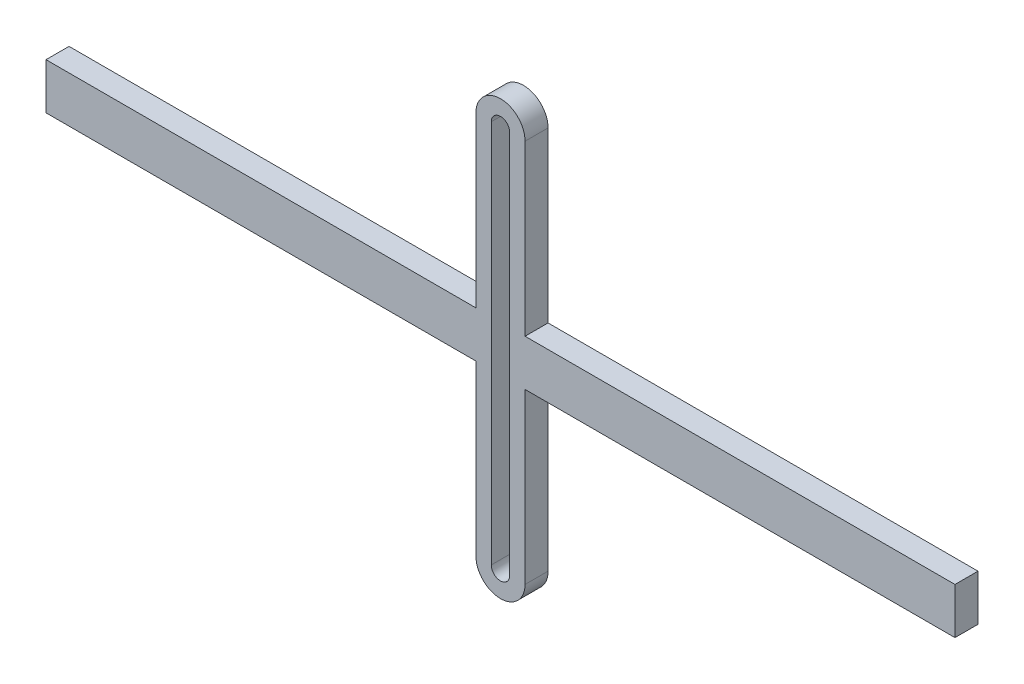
ISO-10303-21;
HEADER;
FILE_DESCRIPTION(('STEP AP214'),'2;1');
FILE_NAME('part.step','',(''),(''),'','','');
FILE_SCHEMA(('AUTOMOTIVE_DESIGN { 1 0 10303 214 1 1 1 1 }'));
ENDSEC;
DATA;
#1=APPLICATION_CONTEXT('core data for automotive mechanical design processes');
#2=APPLICATION_PROTOCOL_DEFINITION('international standard','automotive_design',2000,#1);
#3=PRODUCT_CONTEXT('',#1,'mechanical');
#4=PRODUCT('Part','Part','',(#3));
#5=PRODUCT_RELATED_PRODUCT_CATEGORY('part','',(#4));
#6=PRODUCT_DEFINITION_FORMATION('','',#4);
#7=PRODUCT_DEFINITION_CONTEXT('part definition',#1,'design');
#8=PRODUCT_DEFINITION('design','',#6,#7);
#9=PRODUCT_DEFINITION_SHAPE('','',#8);
#10=(LENGTH_UNIT() NAMED_UNIT(*) SI_UNIT(.MILLI.,.METRE.));
#11=(NAMED_UNIT(*) PLANE_ANGLE_UNIT() SI_UNIT($,.RADIAN.));
#12=(NAMED_UNIT(*) SI_UNIT($,.STERADIAN.) SOLID_ANGLE_UNIT());
#13=UNCERTAINTY_MEASURE_WITH_UNIT(LENGTH_MEASURE(1.E-05),#10,'distance_accuracy_value','');
#14=(GEOMETRIC_REPRESENTATION_CONTEXT(3) GLOBAL_UNCERTAINTY_ASSIGNED_CONTEXT((#13)) GLOBAL_UNIT_ASSIGNED_CONTEXT((#10,
#11,#12)) REPRESENTATION_CONTEXT('',''));
#15=CARTESIAN_POINT('',(0.,0.,0.));
#16=DIRECTION('',(0.,0.,1.));
#17=DIRECTION('',(1.,0.,0.));
#18=AXIS2_PLACEMENT_3D('',#15,#16,#17);
#19=CARTESIAN_POINT('',(-8.,-62.5,7.5));
#20=DIRECTION('',(1.,0.,0.));
#21=DIRECTION('',(0.,0.,-1.));
#22=AXIS2_PLACEMENT_3D('',#19,#20,#21);
#23=PLANE('',#22);
#24=DIRECTION('',(0.,-1.,0.));
#25=VECTOR('',#24,1.);
#26=CARTESIAN_POINT('',(-8.,-62.5,7.5));
#27=LINE('',#26,#25);
#28=CARTESIAN_POINT('',(-7.99999999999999,-7.5,7.5));
#29=VERTEX_POINT('',#28);
#30=CARTESIAN_POINT('',(-8.,-62.5,7.5));
#31=VERTEX_POINT('',#30);
#32=EDGE_CURVE('E298',#29,#31,#27,.T.);
#33=ORIENTED_EDGE('',*,*,#32,.F.);
#34=DIRECTION('',(0.,0.,-1.));
#35=VECTOR('',#34,1.);
#36=CARTESIAN_POINT('',(-7.99999999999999,-7.5,7.5));
#37=LINE('',#36,#35);
#38=CARTESIAN_POINT('',(-7.99999999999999,-7.5,0.));
#39=VERTEX_POINT('',#38);
#40=EDGE_CURVE('E196',#29,#39,#37,.T.);
#41=ORIENTED_EDGE('',*,*,#40,.T.);
#42=DIRECTION('',(0.,-1.,0.));
#43=VECTOR('',#42,1.);
#44=CARTESIAN_POINT('',(-8.,-62.5,0.));
#45=LINE('',#44,#43);
#46=CARTESIAN_POINT('',(-8.,-62.5,0.));
#47=VERTEX_POINT('',#46);
#48=EDGE_CURVE('E167',#39,#47,#45,.T.);
#49=ORIENTED_EDGE('',*,*,#48,.T.);
#50=DIRECTION('',(0.,0.,-1.));
#51=VECTOR('',#50,1.);
#52=CARTESIAN_POINT('',(-8.,-62.5,7.5));
#53=LINE('',#52,#51);
#54=EDGE_CURVE('E303',#31,#47,#53,.T.);
#55=ORIENTED_EDGE('',*,*,#54,.F.);
#56=EDGE_LOOP('',(#33,#41,#49,#55));
#57=FACE_BOUND('',#56,.T.);
#58=ADVANCED_FACE('F45',(#57),#23,.F.);
#59=CARTESIAN_POINT('',(8.,-62.5,7.5));
#60=DIRECTION('',(-1.,0.,0.));
#61=DIRECTION('',(0.,-1.,0.));
#62=AXIS2_PLACEMENT_3D('',#59,#60,#61);
#63=PLANE('',#62);
#64=DIRECTION('',(0.,0.,1.));
#65=VECTOR('',#64,1.);
#66=CARTESIAN_POINT('',(7.99999999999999,7.5,7.5));
#67=LINE('',#66,#65);
#68=CARTESIAN_POINT('',(7.99999999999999,7.50000000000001,0.));
#69=VERTEX_POINT('',#68);
#70=CARTESIAN_POINT('',(7.99999999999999,7.50000000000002,7.5));
#71=VERTEX_POINT('',#70);
#72=EDGE_CURVE('E173',#69,#71,#67,.T.);
#73=ORIENTED_EDGE('',*,*,#72,.F.);
#74=DIRECTION('',(0.,1.,0.));
#75=VECTOR('',#74,1.);
#76=CARTESIAN_POINT('',(8.,-62.5,0.));
#77=LINE('',#76,#75);
#78=CARTESIAN_POINT('',(7.99999999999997,62.5,0.));
#79=VERTEX_POINT('',#78);
#80=EDGE_CURVE('E307',#69,#79,#77,.T.);
#81=ORIENTED_EDGE('',*,*,#80,.T.);
#82=DIRECTION('',(0.,0.,-1.));
#83=VECTOR('',#82,1.);
#84=CARTESIAN_POINT('',(7.99999999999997,62.5,7.5));
#85=LINE('',#84,#83);
#86=CARTESIAN_POINT('',(7.99999999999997,62.5,7.5));
#87=VERTEX_POINT('',#86);
#88=EDGE_CURVE('E54',#87,#79,#85,.T.);
#89=ORIENTED_EDGE('',*,*,#88,.F.);
#90=DIRECTION('',(0.,1.,0.));
#91=VECTOR('',#90,1.);
#92=CARTESIAN_POINT('',(8.,-62.5,7.5));
#93=LINE('',#92,#91);
#94=EDGE_CURVE('E69',#71,#87,#93,.T.);
#95=ORIENTED_EDGE('',*,*,#94,.F.);
#96=EDGE_LOOP('',(#73,#81,#89,#95));
#97=FACE_BOUND('',#96,.T.);
#98=ADVANCED_FACE('F344',(#97),#63,.F.);
#99=DIRECTION('',(0.,0.,-1.));
#100=VECTOR('',#99,1.);
#101=CARTESIAN_POINT('',(7.99999999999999,-7.5,7.5));
#102=LINE('',#101,#100);
#103=CARTESIAN_POINT('',(7.99999999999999,-7.5,7.5));
#104=VERTEX_POINT('',#103);
#105=CARTESIAN_POINT('',(7.99999999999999,-7.5,0.));
#106=VERTEX_POINT('',#105);
#107=EDGE_CURVE('E212',#104,#106,#102,.T.);
#108=ORIENTED_EDGE('',*,*,#107,.F.);
#109=CARTESIAN_POINT('',(8.,-62.5,7.5));
#110=VERTEX_POINT('',#109);
#111=EDGE_CURVE('E291',#110,#104,#93,.T.);
#112=ORIENTED_EDGE('',*,*,#111,.F.);
#113=DIRECTION('',(0.,0.,-1.));
#114=VECTOR('',#113,1.);
#115=CARTESIAN_POINT('',(8.,-62.5,7.5));
#116=LINE('',#115,#114);
#117=CARTESIAN_POINT('',(8.,-62.5,0.));
#118=VERTEX_POINT('',#117);
#119=EDGE_CURVE('E11',#110,#118,#116,.T.);
#120=ORIENTED_EDGE('',*,*,#119,.T.);
#121=EDGE_CURVE('E308',#118,#106,#77,.T.);
#122=ORIENTED_EDGE('',*,*,#121,.T.);
#123=EDGE_LOOP('',(#108,#112,#120,#122));
#124=FACE_BOUND('',#123,.T.);
#125=ADVANCED_FACE('F356',(#124),#63,.F.);
#126=CARTESIAN_POINT('',(0.,-62.5,7.5));
#127=DIRECTION('',(0.,0.,1.));
#128=DIRECTION('',(1.,0.,0.));
#129=AXIS2_PLACEMENT_3D('',#126,#127,#128);
#130=PLANE('',#129);
#131=CARTESIAN_POINT('',(0.,-62.5,7.5));
#132=DIRECTION('',(0.,0.,1.));
#133=DIRECTION('',(1.,0.,0.));
#134=AXIS2_PLACEMENT_3D('',#131,#132,#133);
#135=CIRCLE('',#134,8.);
#136=EDGE_CURVE('E286',#31,#110,#135,.T.);
#137=ORIENTED_EDGE('',*,*,#136,.T.);
#138=ORIENTED_EDGE('',*,*,#111,.T.);
#139=DIRECTION('',(-1.,0.,0.));
#140=VECTOR('',#139,1.);
#141=CARTESIAN_POINT('',(148.,-7.49999999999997,7.5));
#142=LINE('',#141,#140);
#143=CARTESIAN_POINT('',(148.,-7.49999999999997,7.5));
#144=VERTEX_POINT('',#143);
#145=EDGE_CURVE('E230',#144,#104,#142,.T.);
#146=ORIENTED_EDGE('',*,*,#145,.F.);
#147=DIRECTION('',(0.,-1.,0.));
#148=VECTOR('',#147,1.);
#149=CARTESIAN_POINT('',(148.,7.50000000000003,7.5));
#150=LINE('',#149,#148);
#151=CARTESIAN_POINT('',(148.,7.50000000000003,7.5));
#152=VERTEX_POINT('',#151);
#153=EDGE_CURVE('E215',#152,#144,#150,.T.);
#154=ORIENTED_EDGE('',*,*,#153,.F.);
#155=DIRECTION('',(-1.,0.,0.));
#156=VECTOR('',#155,1.);
#157=CARTESIAN_POINT('',(148.,7.50000000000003,7.5));
#158=LINE('',#157,#156);
#159=EDGE_CURVE('E234',#152,#71,#158,.T.);
#160=ORIENTED_EDGE('',*,*,#159,.T.);
#161=ORIENTED_EDGE('',*,*,#94,.T.);
#162=CARTESIAN_POINT('',(0.,62.5,7.5));
#163=DIRECTION('',(0.,0.,1.));
#164=DIRECTION('',(1.,0.,0.));
#165=AXIS2_PLACEMENT_3D('',#162,#163,#164);
#166=CIRCLE('',#165,7.99999999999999);
#167=CARTESIAN_POINT('',(-8.,62.5,7.5));
#168=VERTEX_POINT('',#167);
#169=EDGE_CURVE('E295',#87,#168,#166,.T.);
#170=ORIENTED_EDGE('',*,*,#169,.T.);
#171=CARTESIAN_POINT('',(-8.,7.50000000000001,7.5));
#172=VERTEX_POINT('',#171);
#173=EDGE_CURVE('E299',#168,#172,#27,.T.);
#174=ORIENTED_EDGE('',*,*,#173,.T.);
#175=DIRECTION('',(1.,0.,0.));
#176=VECTOR('',#175,1.);
#177=CARTESIAN_POINT('',(-148.,7.50000000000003,7.5));
#178=LINE('',#177,#176);
#179=CARTESIAN_POINT('',(-148.,7.50000000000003,7.5));
#180=VERTEX_POINT('',#179);
#181=EDGE_CURVE('E61',#180,#172,#178,.T.);
#182=ORIENTED_EDGE('',*,*,#181,.F.);
#183=DIRECTION('',(0.,-1.,0.));
#184=VECTOR('',#183,1.);
#185=CARTESIAN_POINT('',(-148.,7.50000000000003,7.5));
#186=LINE('',#185,#184);
#187=CARTESIAN_POINT('',(-148.,-7.49999999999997,7.5));
#188=VERTEX_POINT('',#187);
#189=EDGE_CURVE('E188',#180,#188,#186,.T.);
#190=ORIENTED_EDGE('',*,*,#189,.T.);
#191=DIRECTION('',(1.,0.,0.));
#192=VECTOR('',#191,1.);
#193=CARTESIAN_POINT('',(-148.,-7.49999999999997,7.5));
#194=LINE('',#193,#192);
#195=EDGE_CURVE('E174',#188,#29,#194,.T.);
#196=ORIENTED_EDGE('',*,*,#195,.T.);
#197=ORIENTED_EDGE('',*,*,#32,.T.);
#198=EDGE_LOOP('',(#137,#138,#146,#154,#160,#161,#170,#174,#182,#190,#196,#197));
#199=FACE_BOUND('',#198,.T.);
#200=DIRECTION('',(0.,1.,0.));
#201=VECTOR('',#200,1.);
#202=CARTESIAN_POINT('',(3.,-62.5,7.5));
#203=LINE('',#202,#201);
#204=CARTESIAN_POINT('',(3.,-62.5,7.5));
#205=VERTEX_POINT('',#204);
#206=CARTESIAN_POINT('',(2.99999999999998,62.5,7.5));
#207=VERTEX_POINT('',#206);
#208=EDGE_CURVE('E246',#205,#207,#203,.T.);
#209=ORIENTED_EDGE('',*,*,#208,.F.);
#210=CARTESIAN_POINT('',(0.,-62.5,7.5));
#211=DIRECTION('',(0.,0.,1.));
#212=DIRECTION('',(1.,0.,0.));
#213=AXIS2_PLACEMENT_3D('',#210,#211,#212);
#214=CIRCLE('',#213,3.);
#215=CARTESIAN_POINT('',(-3.,-62.5,7.5));
#216=VERTEX_POINT('',#215);
#217=EDGE_CURVE('E243',#216,#205,#214,.T.);
#218=ORIENTED_EDGE('',*,*,#217,.F.);
#219=DIRECTION('',(0.,-1.,0.));
#220=VECTOR('',#219,1.);
#221=CARTESIAN_POINT('',(-3.,-62.5,7.5));
#222=LINE('',#221,#220);
#223=CARTESIAN_POINT('',(-3.00000000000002,62.5,7.5));
#224=VERTEX_POINT('',#223);
#225=EDGE_CURVE('E254',#224,#216,#222,.T.);
#226=ORIENTED_EDGE('',*,*,#225,.F.);
#227=CARTESIAN_POINT('',(0.,62.5,7.5));
#228=DIRECTION('',(0.,0.,1.));
#229=DIRECTION('',(1.,0.,0.));
#230=AXIS2_PLACEMENT_3D('',#227,#228,#229);
#231=CIRCLE('',#230,3.);
#232=EDGE_CURVE('E250',#207,#224,#231,.T.);
#233=ORIENTED_EDGE('',*,*,#232,.F.);
#234=EDGE_LOOP('',(#209,#218,#226,#233));
#235=FACE_BOUND('',#234,.T.);
#236=ADVANCED_FACE('F337',(#199,#235),#130,.T.);
#237=CARTESIAN_POINT('',(0.,-62.5,0.));
#238=DIRECTION('',(0.,0.,1.));
#239=DIRECTION('',(1.,0.,0.));
#240=AXIS2_PLACEMENT_3D('',#237,#238,#239);
#241=PLANE('',#240);
#242=CARTESIAN_POINT('',(0.,-62.5,0.));
#243=DIRECTION('',(0.,0.,1.));
#244=DIRECTION('',(1.,0.,0.));
#245=AXIS2_PLACEMENT_3D('',#242,#243,#244);
#246=CIRCLE('',#245,8.);
#247=EDGE_CURVE('E285',#47,#118,#246,.T.);
#248=ORIENTED_EDGE('',*,*,#247,.F.);
#249=ORIENTED_EDGE('',*,*,#48,.F.);
#250=DIRECTION('',(1.,0.,0.));
#251=VECTOR('',#250,1.);
#252=CARTESIAN_POINT('',(-148.,-7.49999999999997,0.));
#253=LINE('',#252,#251);
#254=CARTESIAN_POINT('',(-148.,-7.49999999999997,0.));
#255=VERTEX_POINT('',#254);
#256=EDGE_CURVE('E160',#255,#39,#253,.T.);
#257=ORIENTED_EDGE('',*,*,#256,.F.);
#258=DIRECTION('',(0.,1.,0.));
#259=VECTOR('',#258,1.);
#260=CARTESIAN_POINT('',(-148.,7.50000000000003,0.));
#261=LINE('',#260,#259);
#262=CARTESIAN_POINT('',(-148.,7.50000000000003,0.));
#263=VERTEX_POINT('',#262);
#264=EDGE_CURVE('E165',#255,#263,#261,.T.);
#265=ORIENTED_EDGE('',*,*,#264,.T.);
#266=DIRECTION('',(1.,0.,0.));
#267=VECTOR('',#266,1.);
#268=CARTESIAN_POINT('',(-148.,7.50000000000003,0.));
#269=LINE('',#268,#267);
#270=CARTESIAN_POINT('',(-7.99999999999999,7.5,0.));
#271=VERTEX_POINT('',#270);
#272=EDGE_CURVE('E195',#263,#271,#269,.T.);
#273=ORIENTED_EDGE('',*,*,#272,.T.);
#274=CARTESIAN_POINT('',(-8.,62.5,0.));
#275=VERTEX_POINT('',#274);
#276=EDGE_CURVE('E290',#275,#271,#45,.T.);
#277=ORIENTED_EDGE('',*,*,#276,.F.);
#278=CARTESIAN_POINT('',(0.,62.5,0.));
#279=DIRECTION('',(0.,0.,1.));
#280=DIRECTION('',(1.,0.,0.));
#281=AXIS2_PLACEMENT_3D('',#278,#279,#280);
#282=CIRCLE('',#281,7.99999999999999);
#283=EDGE_CURVE('E311',#79,#275,#282,.T.);
#284=ORIENTED_EDGE('',*,*,#283,.F.);
#285=ORIENTED_EDGE('',*,*,#80,.F.);
#286=DIRECTION('',(-1.,0.,0.));
#287=VECTOR('',#286,1.);
#288=CARTESIAN_POINT('',(148.,7.50000000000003,0.));
#289=LINE('',#288,#287);
#290=CARTESIAN_POINT('',(148.,7.50000000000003,0.));
#291=VERTEX_POINT('',#290);
#292=EDGE_CURVE('E238',#291,#69,#289,.T.);
#293=ORIENTED_EDGE('',*,*,#292,.F.);
#294=DIRECTION('',(0.,1.,0.));
#295=VECTOR('',#294,1.);
#296=CARTESIAN_POINT('',(148.,7.50000000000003,0.));
#297=LINE('',#296,#295);
#298=CARTESIAN_POINT('',(148.,-7.49999999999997,0.));
#299=VERTEX_POINT('',#298);
#300=EDGE_CURVE('E207',#299,#291,#297,.T.);
#301=ORIENTED_EDGE('',*,*,#300,.F.);
#302=DIRECTION('',(-1.,0.,0.));
#303=VECTOR('',#302,1.);
#304=CARTESIAN_POINT('',(148.,-7.49999999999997,0.));
#305=LINE('',#304,#303);
#306=EDGE_CURVE('E221',#299,#106,#305,.T.);
#307=ORIENTED_EDGE('',*,*,#306,.T.);
#308=ORIENTED_EDGE('',*,*,#121,.F.);
#309=EDGE_LOOP('',(#248,#249,#257,#265,#273,#277,#284,#285,#293,#301,#307,#308));
#310=FACE_BOUND('',#309,.T.);
#311=CARTESIAN_POINT('',(0.,-62.5,0.));
#312=DIRECTION('',(0.,0.,1.));
#313=DIRECTION('',(1.,0.,0.));
#314=AXIS2_PLACEMENT_3D('',#311,#312,#313);
#315=CIRCLE('',#314,3.);
#316=CARTESIAN_POINT('',(-3.,-62.5,0.));
#317=VERTEX_POINT('',#316);
#318=CARTESIAN_POINT('',(3.,-62.5,0.));
#319=VERTEX_POINT('',#318);
#320=EDGE_CURVE('E242',#317,#319,#315,.T.);
#321=ORIENTED_EDGE('',*,*,#320,.T.);
#322=DIRECTION('',(0.,1.,0.));
#323=VECTOR('',#322,1.);
#324=CARTESIAN_POINT('',(3.,-62.5,0.));
#325=LINE('',#324,#323);
#326=CARTESIAN_POINT('',(2.99999999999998,62.5,0.));
#327=VERTEX_POINT('',#326);
#328=EDGE_CURVE('E261',#319,#327,#325,.T.);
#329=ORIENTED_EDGE('',*,*,#328,.T.);
#330=CARTESIAN_POINT('',(0.,62.5,0.));
#331=DIRECTION('',(0.,0.,1.));
#332=DIRECTION('',(1.,0.,0.));
#333=AXIS2_PLACEMENT_3D('',#330,#331,#332);
#334=CIRCLE('',#333,3.);
#335=CARTESIAN_POINT('',(-3.00000000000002,62.5,0.));
#336=VERTEX_POINT('',#335);
#337=EDGE_CURVE('E265',#327,#336,#334,.T.);
#338=ORIENTED_EDGE('',*,*,#337,.T.);
#339=DIRECTION('',(0.,-1.,0.));
#340=VECTOR('',#339,1.);
#341=CARTESIAN_POINT('',(-3.,-62.5,0.));
#342=LINE('',#341,#340);
#343=EDGE_CURVE('E247',#336,#317,#342,.T.);
#344=ORIENTED_EDGE('',*,*,#343,.T.);
#345=EDGE_LOOP('',(#321,#329,#338,#344));
#346=FACE_BOUND('',#345,.T.);
#347=ADVANCED_FACE('F163',(#310,#346),#241,.F.);
#348=CARTESIAN_POINT('',(0.,-62.5,7.5));
#349=DIRECTION('',(0.,0.,-1.));
#350=DIRECTION('',(-1.,0.,0.));
#351=AXIS2_PLACEMENT_3D('',#348,#349,#350);
#352=CYLINDRICAL_SURFACE('',#351,8.);
#353=ORIENTED_EDGE('',*,*,#247,.T.);
#354=ORIENTED_EDGE('',*,*,#119,.F.);
#355=ORIENTED_EDGE('',*,*,#136,.F.);
#356=ORIENTED_EDGE('',*,*,#54,.T.);
#357=EDGE_LOOP('',(#353,#354,#355,#356));
#358=FACE_BOUND('',#357,.T.);
#359=ADVANCED_FACE('F47',(#358),#352,.T.);
#360=CARTESIAN_POINT('',(0.,62.5,7.5));
#361=DIRECTION('',(0.,0.,-1.));
#362=DIRECTION('',(-1.,0.,0.));
#363=AXIS2_PLACEMENT_3D('',#360,#361,#362);
#364=CYLINDRICAL_SURFACE('',#363,7.99999999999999);
#365=ORIENTED_EDGE('',*,*,#283,.T.);
#366=DIRECTION('',(0.,0.,-1.));
#367=VECTOR('',#366,1.);
#368=CARTESIAN_POINT('',(-8.,62.5,7.5));
#369=LINE('',#368,#367);
#370=EDGE_CURVE('E320',#168,#275,#369,.T.);
#371=ORIENTED_EDGE('',*,*,#370,.F.);
#372=ORIENTED_EDGE('',*,*,#169,.F.);
#373=ORIENTED_EDGE('',*,*,#88,.T.);
#374=EDGE_LOOP('',(#365,#371,#372,#373));
#375=FACE_BOUND('',#374,.T.);
#376=ADVANCED_FACE('F328',(#375),#364,.T.);
#377=ORIENTED_EDGE('',*,*,#276,.T.);
#378=DIRECTION('',(0.,0.,1.));
#379=VECTOR('',#378,1.);
#380=CARTESIAN_POINT('',(-7.99999999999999,7.5,7.5));
#381=LINE('',#380,#379);
#382=EDGE_CURVE('E184',#271,#172,#381,.T.);
#383=ORIENTED_EDGE('',*,*,#382,.T.);
#384=ORIENTED_EDGE('',*,*,#173,.F.);
#385=ORIENTED_EDGE('',*,*,#370,.T.);
#386=EDGE_LOOP('',(#377,#383,#384,#385));
#387=FACE_BOUND('',#386,.T.);
#388=ADVANCED_FACE('F334',(#387),#23,.F.);
#389=CARTESIAN_POINT('',(0.,-62.5,7.5));
#390=DIRECTION('',(0.,0.,-1.));
#391=DIRECTION('',(-1.,0.,0.));
#392=AXIS2_PLACEMENT_3D('',#389,#390,#391);
#393=CYLINDRICAL_SURFACE('',#392,3.);
#394=ORIENTED_EDGE('',*,*,#320,.F.);
#395=DIRECTION('',(0.,0.,-1.));
#396=VECTOR('',#395,1.);
#397=CARTESIAN_POINT('',(-3.,-62.5,7.5));
#398=LINE('',#397,#396);
#399=EDGE_CURVE('E257',#216,#317,#398,.T.);
#400=ORIENTED_EDGE('',*,*,#399,.F.);
#401=ORIENTED_EDGE('',*,*,#217,.T.);
#402=DIRECTION('',(0.,0.,-1.));
#403=VECTOR('',#402,1.);
#404=CARTESIAN_POINT('',(3.,-62.5,7.5));
#405=LINE('',#404,#403);
#406=EDGE_CURVE('E281',#205,#319,#405,.T.);
#407=ORIENTED_EDGE('',*,*,#406,.T.);
#408=EDGE_LOOP('',(#394,#400,#401,#407));
#409=FACE_BOUND('',#408,.T.);
#410=ADVANCED_FACE('F374',(#409),#393,.F.);
#411=CARTESIAN_POINT('',(3.,-62.5,7.5));
#412=DIRECTION('',(-1.,0.,0.));
#413=DIRECTION('',(0.,-1.,0.));
#414=AXIS2_PLACEMENT_3D('',#411,#412,#413);
#415=PLANE('',#414);
#416=ORIENTED_EDGE('',*,*,#328,.F.);
#417=ORIENTED_EDGE('',*,*,#406,.F.);
#418=ORIENTED_EDGE('',*,*,#208,.T.);
#419=DIRECTION('',(0.,0.,-1.));
#420=VECTOR('',#419,1.);
#421=CARTESIAN_POINT('',(2.99999999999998,62.5,7.5));
#422=LINE('',#421,#420);
#423=EDGE_CURVE('E278',#207,#327,#422,.T.);
#424=ORIENTED_EDGE('',*,*,#423,.T.);
#425=EDGE_LOOP('',(#416,#417,#418,#424));
#426=FACE_BOUND('',#425,.T.);
#427=ADVANCED_FACE('F380',(#426),#415,.T.);
#428=CARTESIAN_POINT('',(0.,62.5,7.5));
#429=DIRECTION('',(0.,0.,-1.));
#430=DIRECTION('',(-1.,0.,0.));
#431=AXIS2_PLACEMENT_3D('',#428,#429,#430);
#432=CYLINDRICAL_SURFACE('',#431,3.);
#433=ORIENTED_EDGE('',*,*,#337,.F.);
#434=ORIENTED_EDGE('',*,*,#423,.F.);
#435=ORIENTED_EDGE('',*,*,#232,.T.);
#436=DIRECTION('',(0.,0.,-1.));
#437=VECTOR('',#436,1.);
#438=CARTESIAN_POINT('',(-3.00000000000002,62.5,7.5));
#439=LINE('',#438,#437);
#440=EDGE_CURVE('E275',#224,#336,#439,.T.);
#441=ORIENTED_EDGE('',*,*,#440,.T.);
#442=EDGE_LOOP('',(#433,#434,#435,#441));
#443=FACE_BOUND('',#442,.T.);
#444=ADVANCED_FACE('F395',(#443),#432,.F.);
#445=CARTESIAN_POINT('',(-3.,-62.5,7.5));
#446=DIRECTION('',(1.,0.,0.));
#447=DIRECTION('',(0.,1.,0.));
#448=AXIS2_PLACEMENT_3D('',#445,#446,#447);
#449=PLANE('',#448);
#450=ORIENTED_EDGE('',*,*,#343,.F.);
#451=ORIENTED_EDGE('',*,*,#440,.F.);
#452=ORIENTED_EDGE('',*,*,#225,.T.);
#453=ORIENTED_EDGE('',*,*,#399,.T.);
#454=EDGE_LOOP('',(#450,#451,#452,#453));
#455=FACE_BOUND('',#454,.T.);
#456=ADVANCED_FACE('F399',(#455),#449,.T.);
#457=CARTESIAN_POINT('',(148.,7.50000000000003,7.5));
#458=DIRECTION('',(0.,-1.,0.));
#459=DIRECTION('',(1.,0.,0.));
#460=AXIS2_PLACEMENT_3D('',#457,#458,#459);
#461=PLANE('',#460);
#462=ORIENTED_EDGE('',*,*,#72,.T.);
#463=ORIENTED_EDGE('',*,*,#159,.F.);
#464=DIRECTION('',(0.,0.,1.));
#465=VECTOR('',#464,1.);
#466=CARTESIAN_POINT('',(148.,7.50000000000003,7.5));
#467=LINE('',#466,#465);
#468=EDGE_CURVE('E211',#291,#152,#467,.T.);
#469=ORIENTED_EDGE('',*,*,#468,.F.);
#470=ORIENTED_EDGE('',*,*,#292,.T.);
#471=EDGE_LOOP('',(#462,#463,#469,#470));
#472=FACE_BOUND('',#471,.T.);
#473=ADVANCED_FACE('F346',(#472),#461,.F.);
#474=CARTESIAN_POINT('',(148.,-7.49999999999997,7.5));
#475=DIRECTION('',(0.,1.,0.));
#476=DIRECTION('',(-1.,0.,0.));
#477=AXIS2_PLACEMENT_3D('',#474,#475,#476);
#478=PLANE('',#477);
#479=ORIENTED_EDGE('',*,*,#107,.T.);
#480=ORIENTED_EDGE('',*,*,#306,.F.);
#481=DIRECTION('',(0.,0.,-1.));
#482=VECTOR('',#481,1.);
#483=CARTESIAN_POINT('',(148.,-7.49999999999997,7.5));
#484=LINE('',#483,#482);
#485=EDGE_CURVE('E218',#144,#299,#484,.T.);
#486=ORIENTED_EDGE('',*,*,#485,.F.);
#487=ORIENTED_EDGE('',*,*,#145,.T.);
#488=EDGE_LOOP('',(#479,#480,#486,#487));
#489=FACE_BOUND('',#488,.T.);
#490=ADVANCED_FACE('F354',(#489),#478,.F.);
#491=CARTESIAN_POINT('',(148.,0.,0.));
#492=DIRECTION('',(1.,0.,0.));
#493=DIRECTION('',(0.,1.,0.));
#494=AXIS2_PLACEMENT_3D('',#491,#492,#493);
#495=PLANE('',#494);
#496=ORIENTED_EDGE('',*,*,#300,.T.);
#497=ORIENTED_EDGE('',*,*,#468,.T.);
#498=ORIENTED_EDGE('',*,*,#153,.T.);
#499=ORIENTED_EDGE('',*,*,#485,.T.);
#500=EDGE_LOOP('',(#496,#497,#498,#499));
#501=FACE_BOUND('',#500,.T.);
#502=ADVANCED_FACE('F350',(#501),#495,.T.);
#503=CARTESIAN_POINT('',(-148.,-7.49999999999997,7.5));
#504=DIRECTION('',(0.,-1.,0.));
#505=DIRECTION('',(1.,0.,0.));
#506=AXIS2_PLACEMENT_3D('',#503,#504,#505);
#507=PLANE('',#506);
#508=ORIENTED_EDGE('',*,*,#40,.F.);
#509=ORIENTED_EDGE('',*,*,#195,.F.);
#510=DIRECTION('',(0.,0.,-1.));
#511=VECTOR('',#510,1.);
#512=CARTESIAN_POINT('',(-148.,-7.49999999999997,7.5));
#513=LINE('',#512,#511);
#514=EDGE_CURVE('E180',#188,#255,#513,.T.);
#515=ORIENTED_EDGE('',*,*,#514,.T.);
#516=ORIENTED_EDGE('',*,*,#256,.T.);
#517=EDGE_LOOP('',(#508,#509,#515,#516));
#518=FACE_BOUND('',#517,.T.);
#519=ADVANCED_FACE('F186',(#518),#507,.T.);
#520=CARTESIAN_POINT('',(-148.,7.50000000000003,7.5));
#521=DIRECTION('',(0.,1.,0.));
#522=DIRECTION('',(-1.,0.,0.));
#523=AXIS2_PLACEMENT_3D('',#520,#521,#522);
#524=PLANE('',#523);
#525=ORIENTED_EDGE('',*,*,#382,.F.);
#526=ORIENTED_EDGE('',*,*,#272,.F.);
#527=DIRECTION('',(0.,0.,1.));
#528=VECTOR('',#527,1.);
#529=CARTESIAN_POINT('',(-148.,7.50000000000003,7.5));
#530=LINE('',#529,#528);
#531=EDGE_CURVE('E182',#263,#180,#530,.T.);
#532=ORIENTED_EDGE('',*,*,#531,.T.);
#533=ORIENTED_EDGE('',*,*,#181,.T.);
#534=EDGE_LOOP('',(#525,#526,#532,#533));
#535=FACE_BOUND('',#534,.T.);
#536=ADVANCED_FACE('F410',(#535),#524,.T.);
#537=CARTESIAN_POINT('',(-148.,0.,0.));
#538=DIRECTION('',(-1.,0.,0.));
#539=DIRECTION('',(0.,1.,0.));
#540=AXIS2_PLACEMENT_3D('',#537,#538,#539);
#541=PLANE('',#540);
#542=ORIENTED_EDGE('',*,*,#264,.F.);
#543=ORIENTED_EDGE('',*,*,#514,.F.);
#544=ORIENTED_EDGE('',*,*,#189,.F.);
#545=ORIENTED_EDGE('',*,*,#531,.F.);
#546=EDGE_LOOP('',(#542,#543,#544,#545));
#547=FACE_BOUND('',#546,.T.);
#548=ADVANCED_FACE('F178',(#547),#541,.T.);
#549=CLOSED_SHELL('',(#58,#98,#125,#236,#347,#359,#376,#388,#410,#427,#444,#456,#473,#490,#502,
#519,#536,#548));
#550=MANIFOLD_SOLID_BREP('B2',#549);
#551=ADVANCED_BREP_SHAPE_REPRESENTATION('',(#18,#550),#14);
#552=SHAPE_DEFINITION_REPRESENTATION(#9,#551);
ENDSEC;
END-ISO-10303-21;
